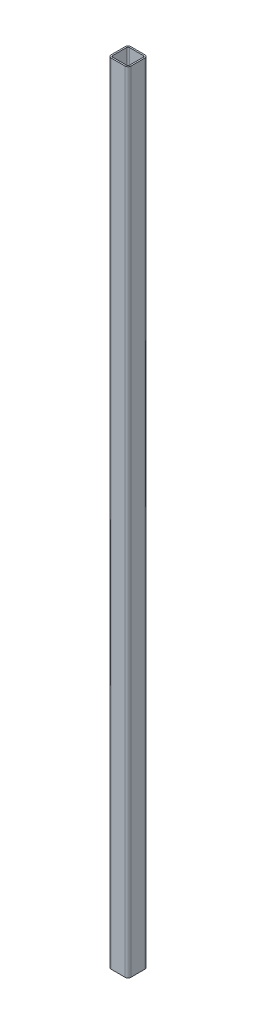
ISO-10303-21;
HEADER;
FILE_DESCRIPTION(('STEP AP214'),'2;1');
FILE_NAME('part.step','',(''),(''),'','','');
FILE_SCHEMA(('AUTOMOTIVE_DESIGN { 1 0 10303 214 1 1 1 1 }'));
ENDSEC;
DATA;
#1=APPLICATION_CONTEXT('core data for automotive mechanical design processes');
#2=APPLICATION_PROTOCOL_DEFINITION('international standard','automotive_design',2000,#1);
#3=PRODUCT_CONTEXT('',#1,'mechanical');
#4=PRODUCT('Part','Part','',(#3));
#5=PRODUCT_RELATED_PRODUCT_CATEGORY('part','',(#4));
#6=PRODUCT_DEFINITION_FORMATION('','',#4);
#7=PRODUCT_DEFINITION_CONTEXT('part definition',#1,'design');
#8=PRODUCT_DEFINITION('design','',#6,#7);
#9=PRODUCT_DEFINITION_SHAPE('','',#8);
#10=(LENGTH_UNIT() NAMED_UNIT(*) SI_UNIT(.MILLI.,.METRE.));
#11=(NAMED_UNIT(*) PLANE_ANGLE_UNIT() SI_UNIT($,.RADIAN.));
#12=(NAMED_UNIT(*) SI_UNIT($,.STERADIAN.) SOLID_ANGLE_UNIT());
#13=UNCERTAINTY_MEASURE_WITH_UNIT(LENGTH_MEASURE(1.E-05),#10,'distance_accuracy_value','');
#14=(GEOMETRIC_REPRESENTATION_CONTEXT(3) GLOBAL_UNCERTAINTY_ASSIGNED_CONTEXT((#13)) GLOBAL_UNIT_ASSIGNED_CONTEXT((#10,
#11,#12)) REPRESENTATION_CONTEXT('',''));
#15=CARTESIAN_POINT('',(0.,0.,0.));
#16=DIRECTION('',(0.,0.,1.));
#17=DIRECTION('',(1.,0.,0.));
#18=AXIS2_PLACEMENT_3D('',#15,#16,#17);
#19=CARTESIAN_POINT('',(-7.,400.,-7.));
#20=DIRECTION('',(0.,1.,0.));
#21=DIRECTION('',(0.,0.,1.));
#22=AXIS2_PLACEMENT_3D('',#19,#20,#21);
#23=PLANE('',#22);
#24=CARTESIAN_POINT('',(-7.,400.,-7.));
#25=DIRECTION('',(0.,1.,0.));
#26=DIRECTION('',(0.,0.,1.));
#27=AXIS2_PLACEMENT_3D('',#24,#25,#26);
#28=CIRCLE('',#27,3.);
#29=CARTESIAN_POINT('',(-7.,400.,-10.));
#30=VERTEX_POINT('',#29);
#31=CARTESIAN_POINT('',(-10.,400.,-7.));
#32=VERTEX_POINT('',#31);
#33=EDGE_CURVE('E314',#30,#32,#28,.T.);
#34=ORIENTED_EDGE('',*,*,#33,.T.);
#35=DIRECTION('',(0.,0.,1.));
#36=VECTOR('',#35,1.);
#37=CARTESIAN_POINT('',(-10.,400.,7.));
#38=LINE('',#37,#36);
#39=CARTESIAN_POINT('',(-10.,400.,7.));
#40=VERTEX_POINT('',#39);
#41=EDGE_CURVE('E318',#32,#40,#38,.T.);
#42=ORIENTED_EDGE('',*,*,#41,.T.);
#43=CARTESIAN_POINT('',(-7.,400.,7.));
#44=DIRECTION('',(0.,1.,0.));
#45=DIRECTION('',(0.,0.,-1.));
#46=AXIS2_PLACEMENT_3D('',#43,#44,#45);
#47=CIRCLE('',#46,3.);
#48=CARTESIAN_POINT('',(-7.,400.,10.));
#49=VERTEX_POINT('',#48);
#50=EDGE_CURVE('E320',#40,#49,#47,.T.);
#51=ORIENTED_EDGE('',*,*,#50,.T.);
#52=DIRECTION('',(1.,0.,0.));
#53=VECTOR('',#52,1.);
#54=CARTESIAN_POINT('',(-7.,400.,10.));
#55=LINE('',#54,#53);
#56=CARTESIAN_POINT('',(7.,400.,10.));
#57=VERTEX_POINT('',#56);
#58=EDGE_CURVE('E323',#49,#57,#55,.T.);
#59=ORIENTED_EDGE('',*,*,#58,.T.);
#60=CARTESIAN_POINT('',(7.,400.,7.));
#61=DIRECTION('',(0.,1.,0.));
#62=DIRECTION('',(0.,0.,-1.));
#63=AXIS2_PLACEMENT_3D('',#60,#61,#62);
#64=CIRCLE('',#63,3.);
#65=CARTESIAN_POINT('',(10.,400.,7.));
#66=VERTEX_POINT('',#65);
#67=EDGE_CURVE('E326',#57,#66,#64,.T.);
#68=ORIENTED_EDGE('',*,*,#67,.T.);
#69=DIRECTION('',(0.,0.,-1.));
#70=VECTOR('',#69,1.);
#71=CARTESIAN_POINT('',(10.,400.,7.));
#72=LINE('',#71,#70);
#73=CARTESIAN_POINT('',(10.,400.,-7.));
#74=VERTEX_POINT('',#73);
#75=EDGE_CURVE('E329',#66,#74,#72,.T.);
#76=ORIENTED_EDGE('',*,*,#75,.T.);
#77=CARTESIAN_POINT('',(7.,400.,-7.));
#78=DIRECTION('',(0.,1.,0.));
#79=DIRECTION('',(0.,0.,1.));
#80=AXIS2_PLACEMENT_3D('',#77,#78,#79);
#81=CIRCLE('',#80,3.);
#82=CARTESIAN_POINT('',(7.,400.,-10.));
#83=VERTEX_POINT('',#82);
#84=EDGE_CURVE('E332',#74,#83,#81,.T.);
#85=ORIENTED_EDGE('',*,*,#84,.T.);
#86=DIRECTION('',(-1.,0.,0.));
#87=VECTOR('',#86,1.);
#88=CARTESIAN_POINT('',(-7.,400.,-10.));
#89=LINE('',#88,#87);
#90=EDGE_CURVE('E335',#83,#30,#89,.T.);
#91=ORIENTED_EDGE('',*,*,#90,.T.);
#92=EDGE_LOOP('',(#34,#42,#51,#59,#68,#76,#85,#91));
#93=FACE_BOUND('',#92,.T.);
#94=DIRECTION('',(0.,0.,1.));
#95=VECTOR('',#94,1.);
#96=CARTESIAN_POINT('',(-8.5,400.,7.));
#97=LINE('',#96,#95);
#98=CARTESIAN_POINT('',(-8.5,400.,-7.));
#99=VERTEX_POINT('',#98);
#100=CARTESIAN_POINT('',(-8.5,400.,7.));
#101=VERTEX_POINT('',#100);
#102=EDGE_CURVE('E250',#99,#101,#97,.T.);
#103=ORIENTED_EDGE('',*,*,#102,.F.);
#104=CARTESIAN_POINT('',(-7.,400.,-7.));
#105=DIRECTION('',(0.,1.,0.));
#106=DIRECTION('',(1.,0.,0.));
#107=AXIS2_PLACEMENT_3D('',#104,#105,#106);
#108=CIRCLE('',#107,1.5);
#109=CARTESIAN_POINT('',(-7.,400.,-8.5));
#110=VERTEX_POINT('',#109);
#111=EDGE_CURVE('E216',#110,#99,#108,.T.);
#112=ORIENTED_EDGE('',*,*,#111,.F.);
#113=DIRECTION('',(-1.,0.,0.));
#114=VECTOR('',#113,1.);
#115=CARTESIAN_POINT('',(-7.,400.,-8.5));
#116=LINE('',#115,#114);
#117=CARTESIAN_POINT('',(7.,400.,-8.5));
#118=VERTEX_POINT('',#117);
#119=EDGE_CURVE('E268',#118,#110,#116,.T.);
#120=ORIENTED_EDGE('',*,*,#119,.F.);
#121=CARTESIAN_POINT('',(7.,400.,-7.));
#122=DIRECTION('',(0.,1.,0.));
#123=DIRECTION('',(1.,0.,0.));
#124=AXIS2_PLACEMENT_3D('',#121,#122,#123);
#125=CIRCLE('',#124,1.5);
#126=CARTESIAN_POINT('',(8.5,400.,-7.));
#127=VERTEX_POINT('',#126);
#128=EDGE_CURVE('E265',#127,#118,#125,.T.);
#129=ORIENTED_EDGE('',*,*,#128,.F.);
#130=DIRECTION('',(0.,0.,-1.));
#131=VECTOR('',#130,1.);
#132=CARTESIAN_POINT('',(8.5,400.,7.));
#133=LINE('',#132,#131);
#134=CARTESIAN_POINT('',(8.5,400.,7.));
#135=VERTEX_POINT('',#134);
#136=EDGE_CURVE('E262',#135,#127,#133,.T.);
#137=ORIENTED_EDGE('',*,*,#136,.F.);
#138=CARTESIAN_POINT('',(7.,400.,7.));
#139=DIRECTION('',(0.,1.,0.));
#140=DIRECTION('',(1.,0.,0.));
#141=AXIS2_PLACEMENT_3D('',#138,#139,#140);
#142=CIRCLE('',#141,1.5);
#143=CARTESIAN_POINT('',(7.,400.,8.5));
#144=VERTEX_POINT('',#143);
#145=EDGE_CURVE('E259',#144,#135,#142,.T.);
#146=ORIENTED_EDGE('',*,*,#145,.F.);
#147=DIRECTION('',(1.,0.,0.));
#148=VECTOR('',#147,1.);
#149=CARTESIAN_POINT('',(-7.,400.,8.5));
#150=LINE('',#149,#148);
#151=CARTESIAN_POINT('',(-7.,400.,8.5));
#152=VERTEX_POINT('',#151);
#153=EDGE_CURVE('E256',#152,#144,#150,.T.);
#154=ORIENTED_EDGE('',*,*,#153,.F.);
#155=CARTESIAN_POINT('',(-7.,400.,7.));
#156=DIRECTION('',(0.,1.,0.));
#157=DIRECTION('',(1.,0.,0.));
#158=AXIS2_PLACEMENT_3D('',#155,#156,#157);
#159=CIRCLE('',#158,1.5);
#160=EDGE_CURVE('E253',#101,#152,#159,.T.);
#161=ORIENTED_EDGE('',*,*,#160,.F.);
#162=EDGE_LOOP('',(#103,#112,#120,#129,#137,#146,#154,#161));
#163=FACE_BOUND('',#162,.T.);
#164=ADVANCED_FACE('F86',(#93,#163),#23,.T.);
#165=CARTESIAN_POINT('',(-7.,-400.,-7.));
#166=DIRECTION('',(0.,1.,0.));
#167=DIRECTION('',(0.,0.,1.));
#168=AXIS2_PLACEMENT_3D('',#165,#166,#167);
#169=PLANE('',#168);
#170=CARTESIAN_POINT('',(-7.,-400.,-7.));
#171=DIRECTION('',(0.,1.,0.));
#172=DIRECTION('',(0.,0.,1.));
#173=AXIS2_PLACEMENT_3D('',#170,#171,#172);
#174=CIRCLE('',#173,3.);
#175=CARTESIAN_POINT('',(-7.,-400.,-10.));
#176=VERTEX_POINT('',#175);
#177=CARTESIAN_POINT('',(-10.,-400.,-7.));
#178=VERTEX_POINT('',#177);
#179=EDGE_CURVE('E218',#176,#178,#174,.T.);
#180=ORIENTED_EDGE('',*,*,#179,.F.);
#181=DIRECTION('',(-1.,0.,0.));
#182=VECTOR('',#181,1.);
#183=CARTESIAN_POINT('',(-7.,-400.,-10.));
#184=LINE('',#183,#182);
#185=CARTESIAN_POINT('',(7.,-400.,-10.));
#186=VERTEX_POINT('',#185);
#187=EDGE_CURVE('E311',#186,#176,#184,.T.);
#188=ORIENTED_EDGE('',*,*,#187,.F.);
#189=CARTESIAN_POINT('',(7.,-400.,-7.));
#190=DIRECTION('',(0.,1.,0.));
#191=DIRECTION('',(0.,0.,1.));
#192=AXIS2_PLACEMENT_3D('',#189,#190,#191);
#193=CIRCLE('',#192,3.);
#194=CARTESIAN_POINT('',(10.,-400.,-7.));
#195=VERTEX_POINT('',#194);
#196=EDGE_CURVE('E308',#195,#186,#193,.T.);
#197=ORIENTED_EDGE('',*,*,#196,.F.);
#198=DIRECTION('',(0.,0.,-1.));
#199=VECTOR('',#198,1.);
#200=CARTESIAN_POINT('',(10.,-400.,7.));
#201=LINE('',#200,#199);
#202=CARTESIAN_POINT('',(10.,-400.,7.));
#203=VERTEX_POINT('',#202);
#204=EDGE_CURVE('E305',#203,#195,#201,.T.);
#205=ORIENTED_EDGE('',*,*,#204,.F.);
#206=CARTESIAN_POINT('',(7.,-400.,7.));
#207=DIRECTION('',(0.,1.,0.));
#208=DIRECTION('',(0.,0.,-1.));
#209=AXIS2_PLACEMENT_3D('',#206,#207,#208);
#210=CIRCLE('',#209,3.);
#211=CARTESIAN_POINT('',(7.,-400.,10.));
#212=VERTEX_POINT('',#211);
#213=EDGE_CURVE('E302',#212,#203,#210,.T.);
#214=ORIENTED_EDGE('',*,*,#213,.F.);
#215=DIRECTION('',(1.,0.,0.));
#216=VECTOR('',#215,1.);
#217=CARTESIAN_POINT('',(-7.,-400.,10.));
#218=LINE('',#217,#216);
#219=CARTESIAN_POINT('',(-7.,-400.,10.));
#220=VERTEX_POINT('',#219);
#221=EDGE_CURVE('E299',#220,#212,#218,.T.);
#222=ORIENTED_EDGE('',*,*,#221,.F.);
#223=CARTESIAN_POINT('',(-7.,-400.,7.));
#224=DIRECTION('',(0.,1.,0.));
#225=DIRECTION('',(0.,0.,-1.));
#226=AXIS2_PLACEMENT_3D('',#223,#224,#225);
#227=CIRCLE('',#226,3.);
#228=CARTESIAN_POINT('',(-10.,-400.,7.));
#229=VERTEX_POINT('',#228);
#230=EDGE_CURVE('E296',#229,#220,#227,.T.);
#231=ORIENTED_EDGE('',*,*,#230,.F.);
#232=DIRECTION('',(0.,0.,1.));
#233=VECTOR('',#232,1.);
#234=CARTESIAN_POINT('',(-10.,-400.,7.));
#235=LINE('',#234,#233);
#236=EDGE_CURVE('E293',#178,#229,#235,.T.);
#237=ORIENTED_EDGE('',*,*,#236,.F.);
#238=EDGE_LOOP('',(#180,#188,#197,#205,#214,#222,#231,#237));
#239=FACE_BOUND('',#238,.T.);
#240=CARTESIAN_POINT('',(-7.,-400.,-7.));
#241=DIRECTION('',(0.,1.,0.));
#242=DIRECTION('',(1.,0.,0.));
#243=AXIS2_PLACEMENT_3D('',#240,#241,#242);
#244=CIRCLE('',#243,1.5);
#245=CARTESIAN_POINT('',(-7.,-400.,-8.5));
#246=VERTEX_POINT('',#245);
#247=CARTESIAN_POINT('',(-8.5,-400.,-7.));
#248=VERTEX_POINT('',#247);
#249=EDGE_CURVE('E110',#246,#248,#244,.T.);
#250=ORIENTED_EDGE('',*,*,#249,.T.);
#251=DIRECTION('',(0.,0.,1.));
#252=VECTOR('',#251,1.);
#253=CARTESIAN_POINT('',(-8.5,-400.,7.));
#254=LINE('',#253,#252);
#255=CARTESIAN_POINT('',(-8.5,-400.,7.));
#256=VERTEX_POINT('',#255);
#257=EDGE_CURVE('E202',#248,#256,#254,.T.);
#258=ORIENTED_EDGE('',*,*,#257,.T.);
#259=CARTESIAN_POINT('',(-7.,-400.,7.));
#260=DIRECTION('',(0.,1.,0.));
#261=DIRECTION('',(1.,0.,0.));
#262=AXIS2_PLACEMENT_3D('',#259,#260,#261);
#263=CIRCLE('',#262,1.5);
#264=CARTESIAN_POINT('',(-7.,-400.,8.5));
#265=VERTEX_POINT('',#264);
#266=EDGE_CURVE('E212',#256,#265,#263,.T.);
#267=ORIENTED_EDGE('',*,*,#266,.T.);
#268=DIRECTION('',(1.,0.,0.));
#269=VECTOR('',#268,1.);
#270=CARTESIAN_POINT('',(-7.,-400.,8.5));
#271=LINE('',#270,#269);
#272=CARTESIAN_POINT('',(7.,-400.,8.5));
#273=VERTEX_POINT('',#272);
#274=EDGE_CURVE('E231',#265,#273,#271,.T.);
#275=ORIENTED_EDGE('',*,*,#274,.T.);
#276=CARTESIAN_POINT('',(7.,-400.,7.));
#277=DIRECTION('',(0.,1.,0.));
#278=DIRECTION('',(1.,0.,0.));
#279=AXIS2_PLACEMENT_3D('',#276,#277,#278);
#280=CIRCLE('',#279,1.5);
#281=CARTESIAN_POINT('',(8.5,-400.,7.));
#282=VERTEX_POINT('',#281);
#283=EDGE_CURVE('E235',#273,#282,#280,.T.);
#284=ORIENTED_EDGE('',*,*,#283,.T.);
#285=DIRECTION('',(0.,0.,-1.));
#286=VECTOR('',#285,1.);
#287=CARTESIAN_POINT('',(8.5,-400.,7.));
#288=LINE('',#287,#286);
#289=CARTESIAN_POINT('',(8.5,-400.,-7.));
#290=VERTEX_POINT('',#289);
#291=EDGE_CURVE('E239',#282,#290,#288,.T.);
#292=ORIENTED_EDGE('',*,*,#291,.T.);
#293=CARTESIAN_POINT('',(7.,-400.,-7.));
#294=DIRECTION('',(0.,1.,0.));
#295=DIRECTION('',(1.,0.,0.));
#296=AXIS2_PLACEMENT_3D('',#293,#294,#295);
#297=CIRCLE('',#296,1.5);
#298=CARTESIAN_POINT('',(7.,-400.,-8.5));
#299=VERTEX_POINT('',#298);
#300=EDGE_CURVE('E243',#290,#299,#297,.T.);
#301=ORIENTED_EDGE('',*,*,#300,.T.);
#302=DIRECTION('',(-1.,0.,0.));
#303=VECTOR('',#302,1.);
#304=CARTESIAN_POINT('',(-7.,-400.,-8.5));
#305=LINE('',#304,#303);
#306=EDGE_CURVE('E223',#299,#246,#305,.T.);
#307=ORIENTED_EDGE('',*,*,#306,.T.);
#308=EDGE_LOOP('',(#250,#258,#267,#275,#284,#292,#301,#307));
#309=FACE_BOUND('',#308,.T.);
#310=ADVANCED_FACE('F221',(#239,#309),#169,.F.);
#311=CARTESIAN_POINT('',(-7.,400.,-7.));
#312=DIRECTION('',(0.,-1.,0.));
#313=DIRECTION('',(0.,0.,-1.));
#314=AXIS2_PLACEMENT_3D('',#311,#312,#313);
#315=CYLINDRICAL_SURFACE('',#314,3.);
#316=ORIENTED_EDGE('',*,*,#179,.T.);
#317=DIRECTION('',(0.,-1.,0.));
#318=VECTOR('',#317,1.);
#319=CARTESIAN_POINT('',(-10.,400.,-7.));
#320=LINE('',#319,#318);
#321=EDGE_CURVE('E12',#32,#178,#320,.T.);
#322=ORIENTED_EDGE('',*,*,#321,.F.);
#323=ORIENTED_EDGE('',*,*,#33,.F.);
#324=DIRECTION('',(0.,-1.,0.));
#325=VECTOR('',#324,1.);
#326=CARTESIAN_POINT('',(-7.,400.,-10.));
#327=LINE('',#326,#325);
#328=EDGE_CURVE('E338',#30,#176,#327,.T.);
#329=ORIENTED_EDGE('',*,*,#328,.T.);
#330=EDGE_LOOP('',(#316,#322,#323,#329));
#331=FACE_BOUND('',#330,.T.);
#332=ADVANCED_FACE('F88',(#331),#315,.T.);
#333=CARTESIAN_POINT('',(-10.,400.,7.));
#334=DIRECTION('',(1.,0.,0.));
#335=DIRECTION('',(0.,0.,-1.));
#336=AXIS2_PLACEMENT_3D('',#333,#334,#335);
#337=PLANE('',#336);
#338=ORIENTED_EDGE('',*,*,#236,.T.);
#339=DIRECTION('',(0.,-1.,0.));
#340=VECTOR('',#339,1.);
#341=CARTESIAN_POINT('',(-10.,400.,7.));
#342=LINE('',#341,#340);
#343=EDGE_CURVE('E95',#40,#229,#342,.T.);
#344=ORIENTED_EDGE('',*,*,#343,.F.);
#345=ORIENTED_EDGE('',*,*,#41,.F.);
#346=ORIENTED_EDGE('',*,*,#321,.T.);
#347=EDGE_LOOP('',(#338,#344,#345,#346));
#348=FACE_BOUND('',#347,.T.);
#349=ADVANCED_FACE('F388',(#348),#337,.F.);
#350=CARTESIAN_POINT('',(-7.,400.,7.));
#351=DIRECTION('',(0.,-1.,0.));
#352=DIRECTION('',(0.,0.,-1.));
#353=AXIS2_PLACEMENT_3D('',#350,#351,#352);
#354=CYLINDRICAL_SURFACE('',#353,3.);
#355=ORIENTED_EDGE('',*,*,#230,.T.);
#356=DIRECTION('',(0.,-1.,0.));
#357=VECTOR('',#356,1.);
#358=CARTESIAN_POINT('',(-7.,400.,10.));
#359=LINE('',#358,#357);
#360=EDGE_CURVE('E358',#49,#220,#359,.T.);
#361=ORIENTED_EDGE('',*,*,#360,.F.);
#362=ORIENTED_EDGE('',*,*,#50,.F.);
#363=ORIENTED_EDGE('',*,*,#343,.T.);
#364=EDGE_LOOP('',(#355,#361,#362,#363));
#365=FACE_BOUND('',#364,.T.);
#366=ADVANCED_FACE('F366',(#365),#354,.T.);
#367=CARTESIAN_POINT('',(-7.,400.,10.));
#368=DIRECTION('',(0.,0.,-1.));
#369=DIRECTION('',(-1.,0.,0.));
#370=AXIS2_PLACEMENT_3D('',#367,#368,#369);
#371=PLANE('',#370);
#372=ORIENTED_EDGE('',*,*,#221,.T.);
#373=DIRECTION('',(0.,-1.,0.));
#374=VECTOR('',#373,1.);
#375=CARTESIAN_POINT('',(7.,400.,10.));
#376=LINE('',#375,#374);
#377=EDGE_CURVE('E354',#57,#212,#376,.T.);
#378=ORIENTED_EDGE('',*,*,#377,.F.);
#379=ORIENTED_EDGE('',*,*,#58,.F.);
#380=ORIENTED_EDGE('',*,*,#360,.T.);
#381=EDGE_LOOP('',(#372,#378,#379,#380));
#382=FACE_BOUND('',#381,.T.);
#383=ADVANCED_FACE('F376',(#382),#371,.F.);
#384=CARTESIAN_POINT('',(7.,400.,7.));
#385=DIRECTION('',(0.,-1.,0.));
#386=DIRECTION('',(0.,0.,-1.));
#387=AXIS2_PLACEMENT_3D('',#384,#385,#386);
#388=CYLINDRICAL_SURFACE('',#387,3.);
#389=ORIENTED_EDGE('',*,*,#213,.T.);
#390=DIRECTION('',(0.,-1.,0.));
#391=VECTOR('',#390,1.);
#392=CARTESIAN_POINT('',(10.,400.,7.));
#393=LINE('',#392,#391);
#394=EDGE_CURVE('E350',#66,#203,#393,.T.);
#395=ORIENTED_EDGE('',*,*,#394,.F.);
#396=ORIENTED_EDGE('',*,*,#67,.F.);
#397=ORIENTED_EDGE('',*,*,#377,.T.);
#398=EDGE_LOOP('',(#389,#395,#396,#397));
#399=FACE_BOUND('',#398,.T.);
#400=ADVANCED_FACE('F380',(#399),#388,.T.);
#401=CARTESIAN_POINT('',(10.,400.,7.));
#402=DIRECTION('',(-1.,0.,0.));
#403=DIRECTION('',(0.,0.,1.));
#404=AXIS2_PLACEMENT_3D('',#401,#402,#403);
#405=PLANE('',#404);
#406=ORIENTED_EDGE('',*,*,#204,.T.);
#407=DIRECTION('',(0.,-1.,0.));
#408=VECTOR('',#407,1.);
#409=CARTESIAN_POINT('',(10.,400.,-7.));
#410=LINE('',#409,#408);
#411=EDGE_CURVE('E346',#74,#195,#410,.T.);
#412=ORIENTED_EDGE('',*,*,#411,.F.);
#413=ORIENTED_EDGE('',*,*,#75,.F.);
#414=ORIENTED_EDGE('',*,*,#394,.T.);
#415=EDGE_LOOP('',(#406,#412,#413,#414));
#416=FACE_BOUND('',#415,.T.);
#417=ADVANCED_FACE('F401',(#416),#405,.F.);
#418=CARTESIAN_POINT('',(7.,400.,-7.));
#419=DIRECTION('',(0.,-1.,0.));
#420=DIRECTION('',(0.,0.,-1.));
#421=AXIS2_PLACEMENT_3D('',#418,#419,#420);
#422=CYLINDRICAL_SURFACE('',#421,3.);
#423=ORIENTED_EDGE('',*,*,#196,.T.);
#424=DIRECTION('',(0.,-1.,0.));
#425=VECTOR('',#424,1.);
#426=CARTESIAN_POINT('',(7.,400.,-10.));
#427=LINE('',#426,#425);
#428=EDGE_CURVE('E342',#83,#186,#427,.T.);
#429=ORIENTED_EDGE('',*,*,#428,.F.);
#430=ORIENTED_EDGE('',*,*,#84,.F.);
#431=ORIENTED_EDGE('',*,*,#411,.T.);
#432=EDGE_LOOP('',(#423,#429,#430,#431));
#433=FACE_BOUND('',#432,.T.);
#434=ADVANCED_FACE('F399',(#433),#422,.T.);
#435=CARTESIAN_POINT('',(-7.,400.,-10.));
#436=DIRECTION('',(0.,0.,1.));
#437=DIRECTION('',(1.,0.,0.));
#438=AXIS2_PLACEMENT_3D('',#435,#436,#437);
#439=PLANE('',#438);
#440=ORIENTED_EDGE('',*,*,#187,.T.);
#441=ORIENTED_EDGE('',*,*,#328,.F.);
#442=ORIENTED_EDGE('',*,*,#90,.F.);
#443=ORIENTED_EDGE('',*,*,#428,.T.);
#444=EDGE_LOOP('',(#440,#441,#442,#443));
#445=FACE_BOUND('',#444,.T.);
#446=ADVANCED_FACE('F394',(#445),#439,.F.);
#447=CARTESIAN_POINT('',(-7.,400.,-7.));
#448=DIRECTION('',(0.,-1.,0.));
#449=DIRECTION('',(0.,0.,-1.));
#450=AXIS2_PLACEMENT_3D('',#447,#448,#449);
#451=CYLINDRICAL_SURFACE('',#450,1.5);
#452=ORIENTED_EDGE('',*,*,#249,.F.);
#453=DIRECTION('',(0.,-1.,0.));
#454=VECTOR('',#453,1.);
#455=CARTESIAN_POINT('',(-7.,400.,-8.5));
#456=LINE('',#455,#454);
#457=EDGE_CURVE('E271',#110,#246,#456,.T.);
#458=ORIENTED_EDGE('',*,*,#457,.F.);
#459=ORIENTED_EDGE('',*,*,#111,.T.);
#460=DIRECTION('',(0.,-1.,0.));
#461=VECTOR('',#460,1.);
#462=CARTESIAN_POINT('',(-8.5,400.,-7.));
#463=LINE('',#462,#461);
#464=EDGE_CURVE('E204',#99,#248,#463,.T.);
#465=ORIENTED_EDGE('',*,*,#464,.T.);
#466=EDGE_LOOP('',(#452,#458,#459,#465));
#467=FACE_BOUND('',#466,.T.);
#468=ADVANCED_FACE('F214',(#467),#451,.F.);
#469=CARTESIAN_POINT('',(-8.5,400.,7.));
#470=DIRECTION('',(1.,0.,0.));
#471=DIRECTION('',(0.,0.,-1.));
#472=AXIS2_PLACEMENT_3D('',#469,#470,#471);
#473=PLANE('',#472);
#474=ORIENTED_EDGE('',*,*,#257,.F.);
#475=ORIENTED_EDGE('',*,*,#464,.F.);
#476=ORIENTED_EDGE('',*,*,#102,.T.);
#477=DIRECTION('',(0.,-1.,0.));
#478=VECTOR('',#477,1.);
#479=CARTESIAN_POINT('',(-8.5,400.,7.));
#480=LINE('',#479,#478);
#481=EDGE_CURVE('E207',#101,#256,#480,.T.);
#482=ORIENTED_EDGE('',*,*,#481,.T.);
#483=EDGE_LOOP('',(#474,#475,#476,#482));
#484=FACE_BOUND('',#483,.T.);
#485=ADVANCED_FACE('F203',(#484),#473,.T.);
#486=CARTESIAN_POINT('',(-7.,400.,7.));
#487=DIRECTION('',(0.,-1.,0.));
#488=DIRECTION('',(0.,0.,-1.));
#489=AXIS2_PLACEMENT_3D('',#486,#487,#488);
#490=CYLINDRICAL_SURFACE('',#489,1.5);
#491=ORIENTED_EDGE('',*,*,#266,.F.);
#492=ORIENTED_EDGE('',*,*,#481,.F.);
#493=ORIENTED_EDGE('',*,*,#160,.T.);
#494=DIRECTION('',(0.,-1.,0.));
#495=VECTOR('',#494,1.);
#496=CARTESIAN_POINT('',(-7.,400.,8.5));
#497=LINE('',#496,#495);
#498=EDGE_CURVE('E285',#152,#265,#497,.T.);
#499=ORIENTED_EDGE('',*,*,#498,.T.);
#500=EDGE_LOOP('',(#491,#492,#493,#499));
#501=FACE_BOUND('',#500,.T.);
#502=ADVANCED_FACE('F425',(#501),#490,.F.);
#503=CARTESIAN_POINT('',(-7.,400.,8.5));
#504=DIRECTION('',(0.,0.,-1.));
#505=DIRECTION('',(-1.,0.,0.));
#506=AXIS2_PLACEMENT_3D('',#503,#504,#505);
#507=PLANE('',#506);
#508=ORIENTED_EDGE('',*,*,#274,.F.);
#509=ORIENTED_EDGE('',*,*,#498,.F.);
#510=ORIENTED_EDGE('',*,*,#153,.T.);
#511=DIRECTION('',(0.,-1.,0.));
#512=VECTOR('',#511,1.);
#513=CARTESIAN_POINT('',(7.,400.,8.5));
#514=LINE('',#513,#512);
#515=EDGE_CURVE('E282',#144,#273,#514,.T.);
#516=ORIENTED_EDGE('',*,*,#515,.T.);
#517=EDGE_LOOP('',(#508,#509,#510,#516));
#518=FACE_BOUND('',#517,.T.);
#519=ADVANCED_FACE('F430',(#518),#507,.T.);
#520=CARTESIAN_POINT('',(7.,400.,7.));
#521=DIRECTION('',(0.,-1.,0.));
#522=DIRECTION('',(0.,0.,-1.));
#523=AXIS2_PLACEMENT_3D('',#520,#521,#522);
#524=CYLINDRICAL_SURFACE('',#523,1.5);
#525=ORIENTED_EDGE('',*,*,#283,.F.);
#526=ORIENTED_EDGE('',*,*,#515,.F.);
#527=ORIENTED_EDGE('',*,*,#145,.T.);
#528=DIRECTION('',(0.,-1.,0.));
#529=VECTOR('',#528,1.);
#530=CARTESIAN_POINT('',(8.5,400.,7.));
#531=LINE('',#530,#529);
#532=EDGE_CURVE('E279',#135,#282,#531,.T.);
#533=ORIENTED_EDGE('',*,*,#532,.T.);
#534=EDGE_LOOP('',(#525,#526,#527,#533));
#535=FACE_BOUND('',#534,.T.);
#536=ADVANCED_FACE('F434',(#535),#524,.F.);
#537=CARTESIAN_POINT('',(8.5,400.,7.));
#538=DIRECTION('',(-1.,0.,0.));
#539=DIRECTION('',(0.,0.,1.));
#540=AXIS2_PLACEMENT_3D('',#537,#538,#539);
#541=PLANE('',#540);
#542=ORIENTED_EDGE('',*,*,#291,.F.);
#543=ORIENTED_EDGE('',*,*,#532,.F.);
#544=ORIENTED_EDGE('',*,*,#136,.T.);
#545=DIRECTION('',(0.,-1.,0.));
#546=VECTOR('',#545,1.);
#547=CARTESIAN_POINT('',(8.5,400.,-7.));
#548=LINE('',#547,#546);
#549=EDGE_CURVE('E276',#127,#290,#548,.T.);
#550=ORIENTED_EDGE('',*,*,#549,.T.);
#551=EDGE_LOOP('',(#542,#543,#544,#550));
#552=FACE_BOUND('',#551,.T.);
#553=ADVANCED_FACE('F438',(#552),#541,.T.);
#554=CARTESIAN_POINT('',(7.,400.,-7.));
#555=DIRECTION('',(0.,-1.,0.));
#556=DIRECTION('',(0.,0.,-1.));
#557=AXIS2_PLACEMENT_3D('',#554,#555,#556);
#558=CYLINDRICAL_SURFACE('',#557,1.5);
#559=ORIENTED_EDGE('',*,*,#300,.F.);
#560=ORIENTED_EDGE('',*,*,#549,.F.);
#561=ORIENTED_EDGE('',*,*,#128,.T.);
#562=DIRECTION('',(0.,-1.,0.));
#563=VECTOR('',#562,1.);
#564=CARTESIAN_POINT('',(7.,400.,-8.5));
#565=LINE('',#564,#563);
#566=EDGE_CURVE('E102',#118,#299,#565,.T.);
#567=ORIENTED_EDGE('',*,*,#566,.T.);
#568=EDGE_LOOP('',(#559,#560,#561,#567));
#569=FACE_BOUND('',#568,.T.);
#570=ADVANCED_FACE('F442',(#569),#558,.F.);
#571=CARTESIAN_POINT('',(-7.,400.,-8.5));
#572=DIRECTION('',(0.,0.,1.));
#573=DIRECTION('',(1.,0.,0.));
#574=AXIS2_PLACEMENT_3D('',#571,#572,#573);
#575=PLANE('',#574);
#576=ORIENTED_EDGE('',*,*,#306,.F.);
#577=ORIENTED_EDGE('',*,*,#566,.F.);
#578=ORIENTED_EDGE('',*,*,#119,.T.);
#579=ORIENTED_EDGE('',*,*,#457,.T.);
#580=EDGE_LOOP('',(#576,#577,#578,#579));
#581=FACE_BOUND('',#580,.T.);
#582=ADVANCED_FACE('F446',(#581),#575,.T.);
#583=CLOSED_SHELL('',(#164,#310,#332,#349,#366,#383,#400,#417,#434,#446,#468,#485,#502,#519,
#536,#553,#570,#582));
#584=MANIFOLD_SOLID_BREP('B2',#583);
#585=ADVANCED_BREP_SHAPE_REPRESENTATION('',(#18,#584),#14);
#586=SHAPE_DEFINITION_REPRESENTATION(#9,#585);
ENDSEC;
END-ISO-10303-21;
